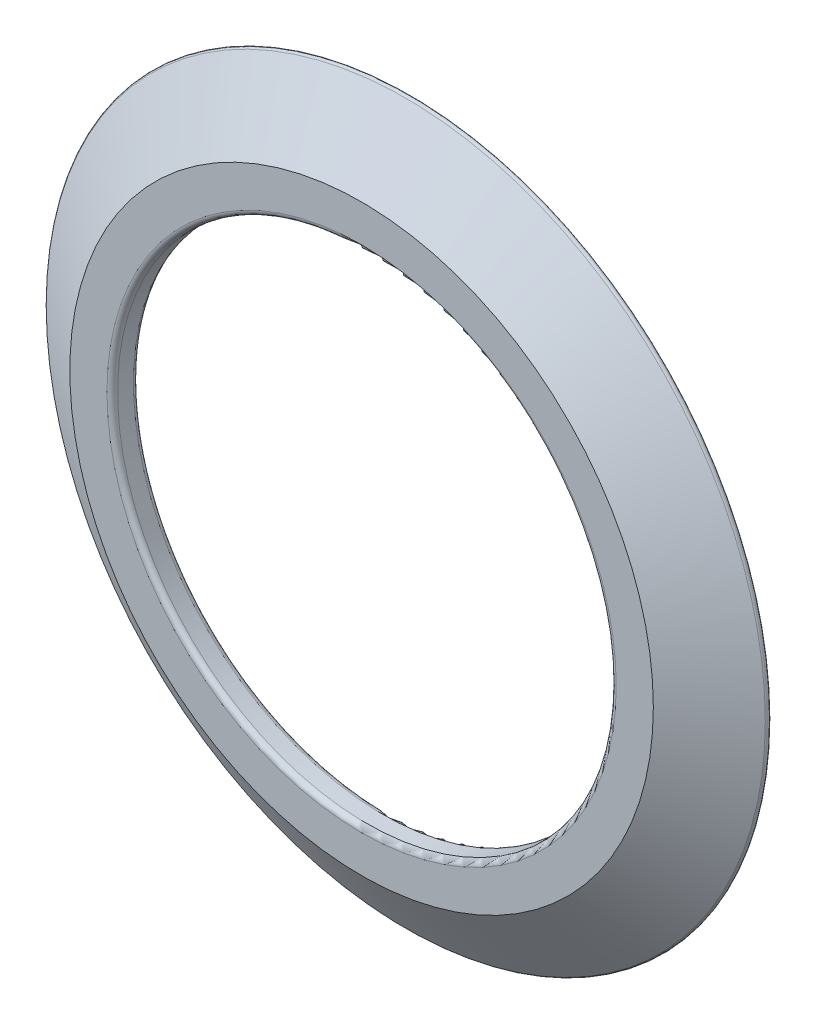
ISO-10303-21;
HEADER;
FILE_DESCRIPTION(('STEP AP214'),'2;1');
FILE_NAME('part.step','',(''),(''),'','','');
FILE_SCHEMA(('AUTOMOTIVE_DESIGN { 1 0 10303 214 1 1 1 1 }'));
ENDSEC;
DATA;
#1=APPLICATION_CONTEXT('core data for automotive mechanical design processes');
#2=APPLICATION_PROTOCOL_DEFINITION('international standard','automotive_design',2000,#1);
#3=PRODUCT_CONTEXT('',#1,'mechanical');
#4=PRODUCT('Part','Part','',(#3));
#5=PRODUCT_RELATED_PRODUCT_CATEGORY('part','',(#4));
#6=PRODUCT_DEFINITION_FORMATION('','',#4);
#7=PRODUCT_DEFINITION_CONTEXT('part definition',#1,'design');
#8=PRODUCT_DEFINITION('design','',#6,#7);
#9=PRODUCT_DEFINITION_SHAPE('','',#8);
#10=(LENGTH_UNIT() NAMED_UNIT(*) SI_UNIT(.MILLI.,.METRE.));
#11=(NAMED_UNIT(*) PLANE_ANGLE_UNIT() SI_UNIT($,.RADIAN.));
#12=(NAMED_UNIT(*) SI_UNIT($,.STERADIAN.) SOLID_ANGLE_UNIT());
#13=UNCERTAINTY_MEASURE_WITH_UNIT(LENGTH_MEASURE(1.E-05),#10,'distance_accuracy_value','');
#14=(GEOMETRIC_REPRESENTATION_CONTEXT(3) GLOBAL_UNCERTAINTY_ASSIGNED_CONTEXT((#13)) GLOBAL_UNIT_ASSIGNED_CONTEXT((#10,
#11,#12)) REPRESENTATION_CONTEXT('',''));
#15=CARTESIAN_POINT('',(0.,0.,0.));
#16=DIRECTION('',(0.,0.,1.));
#17=DIRECTION('',(1.,0.,0.));
#18=AXIS2_PLACEMENT_3D('',#15,#16,#17);
#19=CARTESIAN_POINT('',(0.,0.,0.178247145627));
#20=DIRECTION('',(0.,0.,-1.));
#21=DIRECTION('',(-1.,0.,0.));
#22=AXIS2_PLACEMENT_3D('',#19,#20,#21);
#23=CONICAL_SURFACE('',#22,13.554630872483,0.992845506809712);
#24=CARTESIAN_POINT('',(0.,0.,1.8444887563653));
#25=DIRECTION('',(0.,0.,1.));
#26=DIRECTION('',(1.,0.,0.));
#27=AXIS2_PLACEMENT_3D('',#24,#25,#26);
#28=CIRCLE('',#27,11.);
#29=CARTESIAN_POINT('',(11.,0.,1.8444887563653));
#30=VERTEX_POINT('',#29);
#31=EDGE_CURVE('E8',#30,#30,#28,.T.);
#32=ORIENTED_EDGE('',*,*,#31,.F.);
#33=EDGE_LOOP('',(#32));
#34=FACE_BOUND('',#33,.T.);
#35=CARTESIAN_POINT('',(0.,0.,0.178247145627));
#36=DIRECTION('',(0.,0.,1.));
#37=DIRECTION('',(1.,0.,0.));
#38=AXIS2_PLACEMENT_3D('',#35,#36,#37);
#39=CIRCLE('',#38,13.554630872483);
#40=CARTESIAN_POINT('',(13.554630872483,0.,0.178247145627));
#41=VERTEX_POINT('',#40);
#42=EDGE_CURVE('E40',#41,#41,#39,.T.);
#43=ORIENTED_EDGE('',*,*,#42,.T.);
#44=EDGE_LOOP('',(#43));
#45=FACE_BOUND('',#44,.T.);
#46=ADVANCED_FACE('F12',(#34,#45),#23,.T.);
#47=CARTESIAN_POINT('',(0.,11.,1.8444887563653));
#48=DIRECTION('',(0.,0.,-1.));
#49=DIRECTION('',(-1.,0.,0.));
#50=AXIS2_PLACEMENT_3D('',#47,#48,#49);
#51=PLANE('',#50);
#52=CARTESIAN_POINT('',(0.,0.,1.8444887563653));
#53=DIRECTION('',(0.,0.,1.));
#54=DIRECTION('',(1.,0.,0.));
#55=AXIS2_PLACEMENT_3D('',#52,#53,#54);
#56=CIRCLE('',#55,9.6);
#57=CARTESIAN_POINT('',(9.6,0.,1.8444887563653));
#58=VERTEX_POINT('',#57);
#59=EDGE_CURVE('E18',#58,#58,#56,.T.);
#60=ORIENTED_EDGE('',*,*,#59,.F.);
#61=EDGE_LOOP('',(#60));
#62=FACE_BOUND('',#61,.T.);
#63=ORIENTED_EDGE('',*,*,#31,.T.);
#64=EDGE_LOOP('',(#63));
#65=FACE_BOUND('',#64,.T.);
#66=ADVANCED_FACE('F77',(#62,#65),#51,.F.);
#67=CARTESIAN_POINT('',(0.,0.,1.64448875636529));
#68=DIRECTION('',(0.,0.,1.));
#69=DIRECTION('',(1.,0.,0.));
#70=AXIS2_PLACEMENT_3D('',#67,#68,#69);
#71=TOROIDAL_SURFACE('',#70,9.6,0.200000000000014);
#72=CARTESIAN_POINT('',(0.,0.,1.6444887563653));
#73=DIRECTION('',(0.,0.,1.));
#74=DIRECTION('',(1.,0.,0.));
#75=AXIS2_PLACEMENT_3D('',#72,#73,#74);
#76=CIRCLE('',#75,9.4);
#77=CARTESIAN_POINT('',(9.4,0.,1.6444887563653));
#78=VERTEX_POINT('',#77);
#79=EDGE_CURVE('E22',#78,#78,#76,.T.);
#80=ORIENTED_EDGE('',*,*,#79,.F.);
#81=EDGE_LOOP('',(#80));
#82=FACE_BOUND('',#81,.T.);
#83=ORIENTED_EDGE('',*,*,#59,.T.);
#84=EDGE_LOOP('',(#83));
#85=FACE_BOUND('',#84,.T.);
#86=ADVANCED_FACE('F72',(#82,#85),#71,.T.);
#87=CARTESIAN_POINT('',(0.,0.,-0.00551124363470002));
#88=DIRECTION('',(0.,0.,1.));
#89=DIRECTION('',(1.,0.,0.));
#90=AXIS2_PLACEMENT_3D('',#87,#88,#89);
#91=CYLINDRICAL_SURFACE('',#90,9.4);
#92=CARTESIAN_POINT('',(0.,0.,1.0444887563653));
#93=DIRECTION('',(0.,0.,1.));
#94=DIRECTION('',(1.,0.,0.));
#95=AXIS2_PLACEMENT_3D('',#92,#93,#94);
#96=CIRCLE('',#95,9.4);
#97=CARTESIAN_POINT('',(9.4,0.,1.0444887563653));
#98=VERTEX_POINT('',#97);
#99=EDGE_CURVE('E26',#98,#98,#96,.T.);
#100=ORIENTED_EDGE('',*,*,#99,.F.);
#101=EDGE_LOOP('',(#100));
#102=FACE_BOUND('',#101,.T.);
#103=ORIENTED_EDGE('',*,*,#79,.T.);
#104=EDGE_LOOP('',(#103));
#105=FACE_BOUND('',#104,.T.);
#106=ADVANCED_FACE('F66',(#102,#105),#91,.F.);
#107=CARTESIAN_POINT('',(0.,0.,1.04448875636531));
#108=DIRECTION('',(0.,0.,1.));
#109=DIRECTION('',(1.,0.,0.));
#110=AXIS2_PLACEMENT_3D('',#107,#108,#109);
#111=TOROIDAL_SURFACE('',#110,9.6,0.200000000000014);
#112=CARTESIAN_POINT('',(0.,0.,0.8444887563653));
#113=DIRECTION('',(0.,0.,1.));
#114=DIRECTION('',(1.,0.,0.));
#115=AXIS2_PLACEMENT_3D('',#112,#113,#114);
#116=CIRCLE('',#115,9.6);
#117=CARTESIAN_POINT('',(9.6,0.,0.8444887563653));
#118=VERTEX_POINT('',#117);
#119=EDGE_CURVE('E31',#118,#118,#116,.T.);
#120=ORIENTED_EDGE('',*,*,#119,.F.);
#121=EDGE_LOOP('',(#120));
#122=FACE_BOUND('',#121,.T.);
#123=ORIENTED_EDGE('',*,*,#99,.T.);
#124=EDGE_LOOP('',(#123));
#125=FACE_BOUND('',#124,.T.);
#126=ADVANCED_FACE('F60',(#122,#125),#111,.T.);
#127=CARTESIAN_POINT('',(0.,9.6,0.8444887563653));
#128=DIRECTION('',(0.,0.,1.));
#129=DIRECTION('',(1.,0.,0.));
#130=AXIS2_PLACEMENT_3D('',#127,#128,#129);
#131=PLANE('',#130);
#132=CARTESIAN_POINT('',(0.,0.,0.8444887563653));
#133=DIRECTION('',(0.,0.,1.));
#134=DIRECTION('',(1.,0.,0.));
#135=AXIS2_PLACEMENT_3D('',#132,#133,#134);
#136=CIRCLE('',#135,11.03);
#137=CARTESIAN_POINT('',(11.03,0.,0.8444887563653));
#138=VERTEX_POINT('',#137);
#139=EDGE_CURVE('E34',#138,#138,#136,.T.);
#140=ORIENTED_EDGE('',*,*,#139,.F.);
#141=EDGE_LOOP('',(#140));
#142=FACE_BOUND('',#141,.T.);
#143=ORIENTED_EDGE('',*,*,#119,.T.);
#144=EDGE_LOOP('',(#143));
#145=FACE_BOUND('',#144,.T.);
#146=ADVANCED_FACE('F54',(#142,#145),#131,.F.);
#147=CARTESIAN_POINT('',(0.,0.,0.8444887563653));
#148=DIRECTION('',(0.,0.,-1.));
#149=DIRECTION('',(-1.,0.,0.));
#150=AXIS2_PLACEMENT_3D('',#147,#148,#149);
#151=CONICAL_SURFACE('',#150,11.03,1.23725100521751);
#152=CARTESIAN_POINT('',(0.,0.,0.));
#153=DIRECTION('',(0.,0.,1.));
#154=DIRECTION('',(1.,0.,0.));
#155=AXIS2_PLACEMENT_3D('',#152,#153,#154);
#156=CIRCLE('',#155,13.467260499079);
#157=CARTESIAN_POINT('',(13.467260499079,0.,0.));
#158=VERTEX_POINT('',#157);
#159=EDGE_CURVE('E37',#158,#158,#156,.T.);
#160=ORIENTED_EDGE('',*,*,#159,.F.);
#161=EDGE_LOOP('',(#160));
#162=FACE_BOUND('',#161,.T.);
#163=ORIENTED_EDGE('',*,*,#139,.T.);
#164=EDGE_LOOP('',(#163));
#165=FACE_BOUND('',#164,.T.);
#166=ADVANCED_FACE('F48',(#162,#165),#151,.F.);
#167=CARTESIAN_POINT('',(0.,0.,0.094488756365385));
#168=DIRECTION('',(0.,0.,1.));
#169=DIRECTION('',(1.,0.,0.));
#170=AXIS2_PLACEMENT_3D('',#167,#168,#169);
#171=TOROIDAL_SURFACE('',#170,13.4999999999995,0.100000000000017);
#172=ORIENTED_EDGE('',*,*,#42,.F.);
#173=EDGE_LOOP('',(#172));
#174=FACE_BOUND('',#173,.T.);
#175=ORIENTED_EDGE('',*,*,#159,.T.);
#176=EDGE_LOOP('',(#175));
#177=FACE_BOUND('',#176,.T.);
#178=ADVANCED_FACE('F45',(#174,#177),#171,.T.);
#179=CLOSED_SHELL('',(#46,#66,#86,#106,#126,#146,#166,#178));
#180=MANIFOLD_SOLID_BREP('B1',#179);
#181=ADVANCED_BREP_SHAPE_REPRESENTATION('',(#18,#180),#14);
#182=SHAPE_DEFINITION_REPRESENTATION(#9,#181);
ENDSEC;
END-ISO-10303-21;
